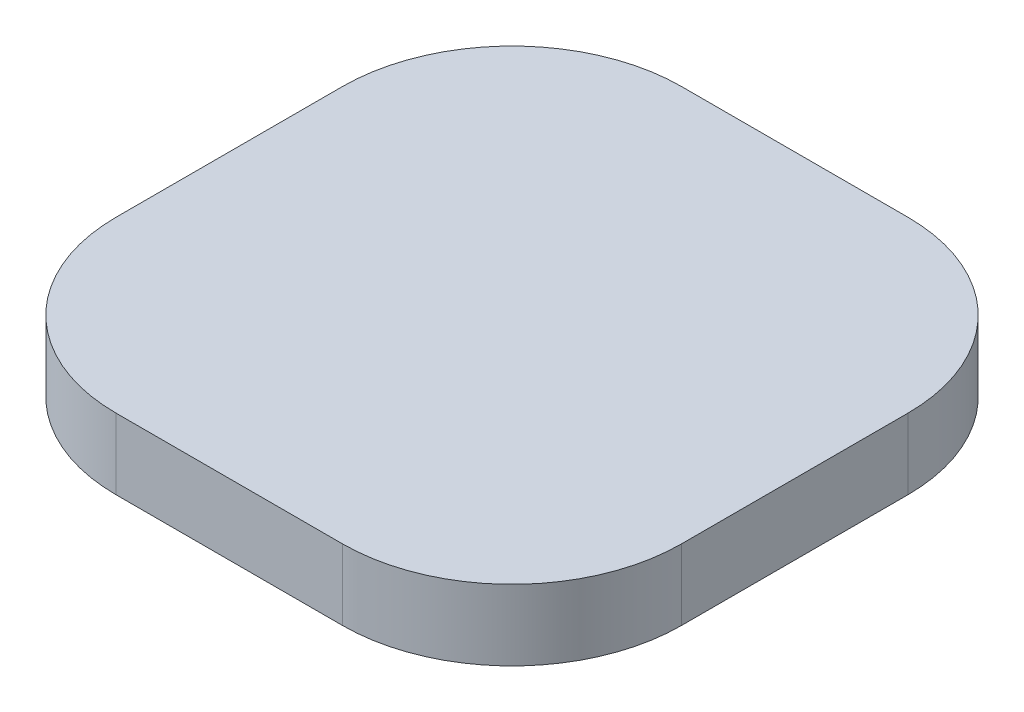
ISO-10303-21;
HEADER;
FILE_DESCRIPTION(('STEP AP214'),'2;1');
FILE_NAME('part.step','',(''),(''),'','','');
FILE_SCHEMA(('AUTOMOTIVE_DESIGN { 1 0 10303 214 1 1 1 1 }'));
ENDSEC;
DATA;
#1=APPLICATION_CONTEXT('core data for automotive mechanical design processes');
#2=APPLICATION_PROTOCOL_DEFINITION('international standard','automotive_design',2000,#1);
#3=PRODUCT_CONTEXT('',#1,'mechanical');
#4=PRODUCT('Part','Part','',(#3));
#5=PRODUCT_RELATED_PRODUCT_CATEGORY('part','',(#4));
#6=PRODUCT_DEFINITION_FORMATION('','',#4);
#7=PRODUCT_DEFINITION_CONTEXT('part definition',#1,'design');
#8=PRODUCT_DEFINITION('design','',#6,#7);
#9=PRODUCT_DEFINITION_SHAPE('','',#8);
#10=(LENGTH_UNIT() NAMED_UNIT(*) SI_UNIT(.MILLI.,.METRE.));
#11=(NAMED_UNIT(*) PLANE_ANGLE_UNIT() SI_UNIT($,.RADIAN.));
#12=(NAMED_UNIT(*) SI_UNIT($,.STERADIAN.) SOLID_ANGLE_UNIT());
#13=UNCERTAINTY_MEASURE_WITH_UNIT(LENGTH_MEASURE(1.E-05),#10,'distance_accuracy_value','');
#14=(GEOMETRIC_REPRESENTATION_CONTEXT(3) GLOBAL_UNCERTAINTY_ASSIGNED_CONTEXT((#13)) GLOBAL_UNIT_ASSIGNED_CONTEXT((#10,
#11,#12)) REPRESENTATION_CONTEXT('',''));
#15=CARTESIAN_POINT('',(0.,0.,0.));
#16=DIRECTION('',(0.,0.,1.));
#17=DIRECTION('',(1.,0.,0.));
#18=AXIS2_PLACEMENT_3D('',#15,#16,#17);
#19=CARTESIAN_POINT('',(15.24,6.35,-15.24));
#20=DIRECTION('',(0.,-1.,0.));
#21=DIRECTION('',(0.,0.,-1.));
#22=AXIS2_PLACEMENT_3D('',#19,#20,#21);
#23=CYLINDRICAL_SURFACE('',#22,15.24);
#24=CARTESIAN_POINT('',(15.24,0.,-15.24));
#25=DIRECTION('',(0.,1.,0.));
#26=DIRECTION('',(0.,0.,-1.));
#27=AXIS2_PLACEMENT_3D('',#24,#25,#26);
#28=CIRCLE('',#27,15.24);
#29=CARTESIAN_POINT('',(0.,0.,-15.2400000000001));
#30=VERTEX_POINT('',#29);
#31=CARTESIAN_POINT('',(15.2400000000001,0.,0.));
#32=VERTEX_POINT('',#31);
#33=EDGE_CURVE('E129',#30,#32,#28,.T.);
#34=ORIENTED_EDGE('',*,*,#33,.T.);
#35=DIRECTION('',(0.,-1.,0.));
#36=VECTOR('',#35,1.);
#37=CARTESIAN_POINT('',(15.2400000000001,6.35,0.));
#38=LINE('',#37,#36);
#39=CARTESIAN_POINT('',(15.2400000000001,6.35,0.));
#40=VERTEX_POINT('',#39);
#41=EDGE_CURVE('E11',#40,#32,#38,.T.);
#42=ORIENTED_EDGE('',*,*,#41,.F.);
#43=CARTESIAN_POINT('',(15.24,6.35,-15.24));
#44=DIRECTION('',(0.,1.,0.));
#45=DIRECTION('',(0.,0.,-1.));
#46=AXIS2_PLACEMENT_3D('',#43,#44,#45);
#47=CIRCLE('',#46,15.24);
#48=CARTESIAN_POINT('',(0.,6.35,-15.2400000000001));
#49=VERTEX_POINT('',#48);
#50=EDGE_CURVE('E143',#49,#40,#47,.T.);
#51=ORIENTED_EDGE('',*,*,#50,.F.);
#52=DIRECTION('',(0.,-1.,0.));
#53=VECTOR('',#52,1.);
#54=CARTESIAN_POINT('',(0.,6.35,-15.2400000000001));
#55=LINE('',#54,#53);
#56=EDGE_CURVE('E125',#49,#30,#55,.T.);
#57=ORIENTED_EDGE('',*,*,#56,.T.);
#58=EDGE_LOOP('',(#34,#42,#51,#57));
#59=FACE_BOUND('',#58,.T.);
#60=ADVANCED_FACE('F33',(#59),#23,.T.);
#61=CARTESIAN_POINT('',(15.2400000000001,6.35,0.));
#62=DIRECTION('',(0.,0.,-1.));
#63=DIRECTION('',(-1.,0.,0.));
#64=AXIS2_PLACEMENT_3D('',#61,#62,#63);
#65=PLANE('',#64);
#66=DIRECTION('',(1.,0.,0.));
#67=VECTOR('',#66,1.);
#68=CARTESIAN_POINT('',(15.2400000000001,0.,0.));
#69=LINE('',#68,#67);
#70=CARTESIAN_POINT('',(35.5599999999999,0.,0.));
#71=VERTEX_POINT('',#70);
#72=EDGE_CURVE('E132',#32,#71,#69,.T.);
#73=ORIENTED_EDGE('',*,*,#72,.T.);
#74=DIRECTION('',(0.,-1.,0.));
#75=VECTOR('',#74,1.);
#76=CARTESIAN_POINT('',(35.5599999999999,6.35,0.));
#77=LINE('',#76,#75);
#78=CARTESIAN_POINT('',(35.5599999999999,6.35,0.));
#79=VERTEX_POINT('',#78);
#80=EDGE_CURVE('E41',#79,#71,#77,.T.);
#81=ORIENTED_EDGE('',*,*,#80,.F.);
#82=DIRECTION('',(1.,0.,0.));
#83=VECTOR('',#82,1.);
#84=CARTESIAN_POINT('',(15.2400000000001,6.35,0.));
#85=LINE('',#84,#83);
#86=EDGE_CURVE('E92',#40,#79,#85,.T.);
#87=ORIENTED_EDGE('',*,*,#86,.F.);
#88=ORIENTED_EDGE('',*,*,#41,.T.);
#89=EDGE_LOOP('',(#73,#81,#87,#88));
#90=FACE_BOUND('',#89,.T.);
#91=ADVANCED_FACE('F178',(#90),#65,.F.);
#92=CARTESIAN_POINT('',(35.56,6.35,-15.24));
#93=DIRECTION('',(0.,-1.,0.));
#94=DIRECTION('',(0.,0.,-1.));
#95=AXIS2_PLACEMENT_3D('',#92,#93,#94);
#96=CYLINDRICAL_SURFACE('',#95,15.24);
#97=CARTESIAN_POINT('',(35.56,0.,-15.24));
#98=DIRECTION('',(0.,1.,0.));
#99=DIRECTION('',(0.,0.,1.));
#100=AXIS2_PLACEMENT_3D('',#97,#98,#99);
#101=CIRCLE('',#100,15.24);
#102=CARTESIAN_POINT('',(50.8,0.,-15.2400000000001));
#103=VERTEX_POINT('',#102);
#104=EDGE_CURVE('E134',#71,#103,#101,.T.);
#105=ORIENTED_EDGE('',*,*,#104,.T.);
#106=DIRECTION('',(0.,-1.,0.));
#107=VECTOR('',#106,1.);
#108=CARTESIAN_POINT('',(50.8,6.35,-15.2400000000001));
#109=LINE('',#108,#107);
#110=CARTESIAN_POINT('',(50.8,6.35,-15.2400000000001));
#111=VERTEX_POINT('',#110);
#112=EDGE_CURVE('E150',#111,#103,#109,.T.);
#113=ORIENTED_EDGE('',*,*,#112,.F.);
#114=CARTESIAN_POINT('',(35.56,6.35,-15.24));
#115=DIRECTION('',(0.,1.,0.));
#116=DIRECTION('',(0.,0.,1.));
#117=AXIS2_PLACEMENT_3D('',#114,#115,#116);
#118=CIRCLE('',#117,15.24);
#119=EDGE_CURVE('E158',#79,#111,#118,.T.);
#120=ORIENTED_EDGE('',*,*,#119,.F.);
#121=ORIENTED_EDGE('',*,*,#80,.T.);
#122=EDGE_LOOP('',(#105,#113,#120,#121));
#123=FACE_BOUND('',#122,.T.);
#124=ADVANCED_FACE('F156',(#123),#96,.T.);
#125=CARTESIAN_POINT('',(50.8,6.35,-15.2400000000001));
#126=DIRECTION('',(-1.,0.,0.));
#127=DIRECTION('',(0.,0.,1.));
#128=AXIS2_PLACEMENT_3D('',#125,#126,#127);
#129=PLANE('',#128);
#130=DIRECTION('',(0.,0.,-1.));
#131=VECTOR('',#130,1.);
#132=CARTESIAN_POINT('',(50.8,0.,-15.2400000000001));
#133=LINE('',#132,#131);
#134=CARTESIAN_POINT('',(50.8,0.,-35.5599999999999));
#135=VERTEX_POINT('',#134);
#136=EDGE_CURVE('E136',#103,#135,#133,.T.);
#137=ORIENTED_EDGE('',*,*,#136,.T.);
#138=DIRECTION('',(0.,-1.,0.));
#139=VECTOR('',#138,1.);
#140=CARTESIAN_POINT('',(50.8,6.35,-35.5599999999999));
#141=LINE('',#140,#139);
#142=CARTESIAN_POINT('',(50.8,6.35,-35.5599999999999));
#143=VERTEX_POINT('',#142);
#144=EDGE_CURVE('E147',#143,#135,#141,.T.);
#145=ORIENTED_EDGE('',*,*,#144,.F.);
#146=DIRECTION('',(0.,0.,-1.));
#147=VECTOR('',#146,1.);
#148=CARTESIAN_POINT('',(50.8,6.35,-15.2400000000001));
#149=LINE('',#148,#147);
#150=EDGE_CURVE('E170',#111,#143,#149,.T.);
#151=ORIENTED_EDGE('',*,*,#150,.F.);
#152=ORIENTED_EDGE('',*,*,#112,.T.);
#153=EDGE_LOOP('',(#137,#145,#151,#152));
#154=FACE_BOUND('',#153,.T.);
#155=ADVANCED_FACE('F166',(#154),#129,.F.);
#156=CARTESIAN_POINT('',(35.56,6.35,-35.56));
#157=DIRECTION('',(0.,-1.,0.));
#158=DIRECTION('',(0.,0.,-1.));
#159=AXIS2_PLACEMENT_3D('',#156,#157,#158);
#160=CYLINDRICAL_SURFACE('',#159,15.24);
#161=CARTESIAN_POINT('',(35.56,0.,-35.56));
#162=DIRECTION('',(0.,1.,0.));
#163=DIRECTION('',(0.,0.,-1.));
#164=AXIS2_PLACEMENT_3D('',#161,#162,#163);
#165=CIRCLE('',#164,15.24);
#166=CARTESIAN_POINT('',(35.5599999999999,0.,-50.8));
#167=VERTEX_POINT('',#166);
#168=EDGE_CURVE('E138',#135,#167,#165,.T.);
#169=ORIENTED_EDGE('',*,*,#168,.T.);
#170=DIRECTION('',(0.,-1.,0.));
#171=VECTOR('',#170,1.);
#172=CARTESIAN_POINT('',(35.5599999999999,6.35,-50.8));
#173=LINE('',#172,#171);
#174=CARTESIAN_POINT('',(35.5599999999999,6.35,-50.8));
#175=VERTEX_POINT('',#174);
#176=EDGE_CURVE('E120',#175,#167,#173,.T.);
#177=ORIENTED_EDGE('',*,*,#176,.F.);
#178=CARTESIAN_POINT('',(35.56,6.35,-35.56));
#179=DIRECTION('',(0.,1.,0.));
#180=DIRECTION('',(0.,0.,-1.));
#181=AXIS2_PLACEMENT_3D('',#178,#179,#180);
#182=CIRCLE('',#181,15.24);
#183=EDGE_CURVE('E111',#143,#175,#182,.T.);
#184=ORIENTED_EDGE('',*,*,#183,.F.);
#185=ORIENTED_EDGE('',*,*,#144,.T.);
#186=EDGE_LOOP('',(#169,#177,#184,#185));
#187=FACE_BOUND('',#186,.T.);
#188=ADVANCED_FACE('F169',(#187),#160,.T.);
#189=CARTESIAN_POINT('',(15.2400000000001,6.35,-50.8));
#190=DIRECTION('',(0.,0.,1.));
#191=DIRECTION('',(1.,0.,0.));
#192=AXIS2_PLACEMENT_3D('',#189,#190,#191);
#193=PLANE('',#192);
#194=DIRECTION('',(-1.,0.,0.));
#195=VECTOR('',#194,1.);
#196=CARTESIAN_POINT('',(15.2400000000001,0.,-50.8));
#197=LINE('',#196,#195);
#198=CARTESIAN_POINT('',(15.2400000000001,0.,-50.8));
#199=VERTEX_POINT('',#198);
#200=EDGE_CURVE('E119',#167,#199,#197,.T.);
#201=ORIENTED_EDGE('',*,*,#200,.T.);
#202=DIRECTION('',(0.,-1.,0.));
#203=VECTOR('',#202,1.);
#204=CARTESIAN_POINT('',(15.2400000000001,6.35,-50.8));
#205=LINE('',#204,#203);
#206=CARTESIAN_POINT('',(15.2400000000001,6.35,-50.8));
#207=VERTEX_POINT('',#206);
#208=EDGE_CURVE('E116',#207,#199,#205,.T.);
#209=ORIENTED_EDGE('',*,*,#208,.F.);
#210=DIRECTION('',(-1.,0.,0.));
#211=VECTOR('',#210,1.);
#212=CARTESIAN_POINT('',(15.2400000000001,6.35,-50.8));
#213=LINE('',#212,#211);
#214=EDGE_CURVE('E105',#175,#207,#213,.T.);
#215=ORIENTED_EDGE('',*,*,#214,.F.);
#216=ORIENTED_EDGE('',*,*,#176,.T.);
#217=EDGE_LOOP('',(#201,#209,#215,#216));
#218=FACE_BOUND('',#217,.T.);
#219=ADVANCED_FACE('F117',(#218),#193,.F.);
#220=CARTESIAN_POINT('',(15.24,6.35,-35.56));
#221=DIRECTION('',(0.,-1.,0.));
#222=DIRECTION('',(0.,0.,-1.));
#223=AXIS2_PLACEMENT_3D('',#220,#221,#222);
#224=CYLINDRICAL_SURFACE('',#223,15.24);
#225=CARTESIAN_POINT('',(15.24,0.,-35.56));
#226=DIRECTION('',(0.,1.,0.));
#227=DIRECTION('',(0.,0.,-1.));
#228=AXIS2_PLACEMENT_3D('',#225,#226,#227);
#229=CIRCLE('',#228,15.24);
#230=CARTESIAN_POINT('',(0.,0.,-35.5599999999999));
#231=VERTEX_POINT('',#230);
#232=EDGE_CURVE('E78',#199,#231,#229,.T.);
#233=ORIENTED_EDGE('',*,*,#232,.T.);
#234=DIRECTION('',(0.,-1.,0.));
#235=VECTOR('',#234,1.);
#236=CARTESIAN_POINT('',(0.,6.35,-35.5599999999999));
#237=LINE('',#236,#235);
#238=CARTESIAN_POINT('',(0.,6.35,-35.5599999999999));
#239=VERTEX_POINT('',#238);
#240=EDGE_CURVE('E121',#239,#231,#237,.T.);
#241=ORIENTED_EDGE('',*,*,#240,.F.);
#242=CARTESIAN_POINT('',(15.24,6.35,-35.56));
#243=DIRECTION('',(0.,1.,0.));
#244=DIRECTION('',(0.,0.,-1.));
#245=AXIS2_PLACEMENT_3D('',#242,#243,#244);
#246=CIRCLE('',#245,15.24);
#247=EDGE_CURVE('E109',#207,#239,#246,.T.);
#248=ORIENTED_EDGE('',*,*,#247,.F.);
#249=ORIENTED_EDGE('',*,*,#208,.T.);
#250=EDGE_LOOP('',(#233,#241,#248,#249));
#251=FACE_BOUND('',#250,.T.);
#252=ADVANCED_FACE('F123',(#251),#224,.T.);
#253=CARTESIAN_POINT('',(0.,6.35,-15.2400000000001));
#254=DIRECTION('',(1.,0.,0.));
#255=DIRECTION('',(0.,0.,-1.));
#256=AXIS2_PLACEMENT_3D('',#253,#254,#255);
#257=PLANE('',#256);
#258=DIRECTION('',(0.,0.,1.));
#259=VECTOR('',#258,1.);
#260=CARTESIAN_POINT('',(0.,0.,-15.2400000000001));
#261=LINE('',#260,#259);
#262=EDGE_CURVE('E84',#231,#30,#261,.T.);
#263=ORIENTED_EDGE('',*,*,#262,.T.);
#264=ORIENTED_EDGE('',*,*,#56,.F.);
#265=DIRECTION('',(0.,0.,1.));
#266=VECTOR('',#265,1.);
#267=CARTESIAN_POINT('',(0.,6.35,-15.2400000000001));
#268=LINE('',#267,#266);
#269=EDGE_CURVE('E49',#239,#49,#268,.T.);
#270=ORIENTED_EDGE('',*,*,#269,.F.);
#271=ORIENTED_EDGE('',*,*,#240,.T.);
#272=EDGE_LOOP('',(#263,#264,#270,#271));
#273=FACE_BOUND('',#272,.T.);
#274=ADVANCED_FACE('F194',(#273),#257,.F.);
#275=CARTESIAN_POINT('',(15.24,6.35,-15.24));
#276=DIRECTION('',(0.,-1.,0.));
#277=DIRECTION('',(0.,0.,-1.));
#278=AXIS2_PLACEMENT_3D('',#275,#276,#277);
#279=PLANE('',#278);
#280=ORIENTED_EDGE('',*,*,#50,.T.);
#281=ORIENTED_EDGE('',*,*,#86,.T.);
#282=ORIENTED_EDGE('',*,*,#119,.T.);
#283=ORIENTED_EDGE('',*,*,#150,.T.);
#284=ORIENTED_EDGE('',*,*,#183,.T.);
#285=ORIENTED_EDGE('',*,*,#214,.T.);
#286=ORIENTED_EDGE('',*,*,#247,.T.);
#287=ORIENTED_EDGE('',*,*,#269,.T.);
#288=EDGE_LOOP('',(#280,#281,#282,#283,#284,#285,#286,#287));
#289=FACE_BOUND('',#288,.T.);
#290=ADVANCED_FACE('F107',(#289),#279,.F.);
#291=CARTESIAN_POINT('',(15.24,0.,-15.24));
#292=DIRECTION('',(0.,-1.,0.));
#293=DIRECTION('',(0.,0.,-1.));
#294=AXIS2_PLACEMENT_3D('',#291,#292,#293);
#295=PLANE('',#294);
#296=ORIENTED_EDGE('',*,*,#33,.F.);
#297=ORIENTED_EDGE('',*,*,#262,.F.);
#298=ORIENTED_EDGE('',*,*,#232,.F.);
#299=ORIENTED_EDGE('',*,*,#200,.F.);
#300=ORIENTED_EDGE('',*,*,#168,.F.);
#301=ORIENTED_EDGE('',*,*,#136,.F.);
#302=ORIENTED_EDGE('',*,*,#104,.F.);
#303=ORIENTED_EDGE('',*,*,#72,.F.);
#304=EDGE_LOOP('',(#296,#297,#298,#299,#300,#301,#302,#303));
#305=FACE_BOUND('',#304,.T.);
#306=ADVANCED_FACE('F162',(#305),#295,.T.);
#307=CLOSED_SHELL('',(#60,#91,#124,#155,#188,#219,#252,#274,#290,#306));
#308=MANIFOLD_SOLID_BREP('B2',#307);
#309=ADVANCED_BREP_SHAPE_REPRESENTATION('',(#18,#308),#14);
#310=SHAPE_DEFINITION_REPRESENTATION(#9,#309);
ENDSEC;
END-ISO-10303-21;
